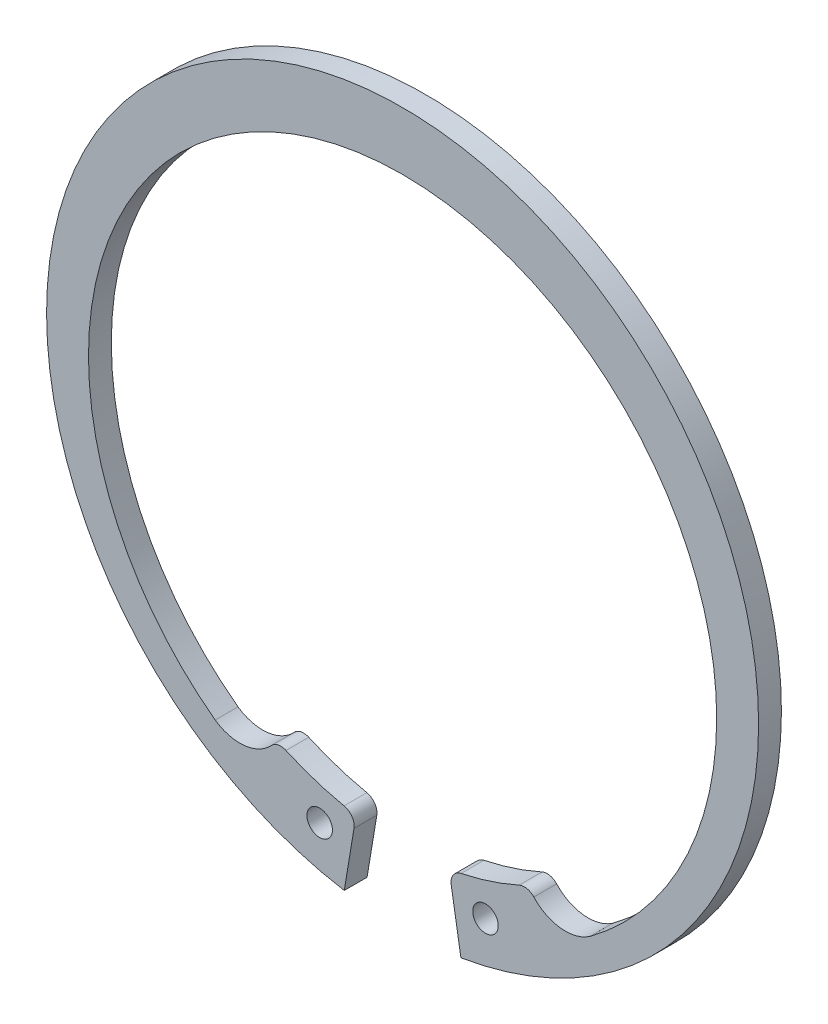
ISO-10303-21;
HEADER;
FILE_DESCRIPTION(('STEP AP214'),'2;1');
FILE_NAME('part.step','',(''),(''),'','','');
FILE_SCHEMA(('AUTOMOTIVE_DESIGN { 1 0 10303 214 1 1 1 1 }'));
ENDSEC;
DATA;
#1=APPLICATION_CONTEXT('core data for automotive mechanical design processes');
#2=APPLICATION_PROTOCOL_DEFINITION('international standard','automotive_design',2000,#1);
#3=PRODUCT_CONTEXT('',#1,'mechanical');
#4=PRODUCT('Part','Part','',(#3));
#5=PRODUCT_RELATED_PRODUCT_CATEGORY('part','',(#4));
#6=PRODUCT_DEFINITION_FORMATION('','',#4);
#7=PRODUCT_DEFINITION_CONTEXT('part definition',#1,'design');
#8=PRODUCT_DEFINITION('design','',#6,#7);
#9=PRODUCT_DEFINITION_SHAPE('','',#8);
#10=(LENGTH_UNIT() NAMED_UNIT(*) SI_UNIT(.MILLI.,.METRE.));
#11=(NAMED_UNIT(*) PLANE_ANGLE_UNIT() SI_UNIT($,.RADIAN.));
#12=(NAMED_UNIT(*) SI_UNIT($,.STERADIAN.) SOLID_ANGLE_UNIT());
#13=UNCERTAINTY_MEASURE_WITH_UNIT(LENGTH_MEASURE(1.E-05),#10,'distance_accuracy_value','');
#14=(GEOMETRIC_REPRESENTATION_CONTEXT(3) GLOBAL_UNCERTAINTY_ASSIGNED_CONTEXT((#13)) GLOBAL_UNIT_ASSIGNED_CONTEXT((#10,
#11,#12)) REPRESENTATION_CONTEXT('',''));
#15=CARTESIAN_POINT('',(0.,0.,0.));
#16=DIRECTION('',(0.,0.,1.));
#17=DIRECTION('',(1.,0.,0.));
#18=AXIS2_PLACEMENT_3D('',#15,#16,#17);
#19=CARTESIAN_POINT('',(0.,0.,-2.5));
#20=DIRECTION('',(0.,0.,1.));
#21=DIRECTION('',(1.00000000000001,0.,0.));
#22=AXIS2_PLACEMENT_3D('',#19,#20,#21);
#23=CYLINDRICAL_SURFACE('',#22,39.);
#24=CARTESIAN_POINT('',(0.,0.,-2.5));
#25=DIRECTION('',(0.,0.,1.));
#26=DIRECTION('',(1.00000000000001,0.,0.));
#27=AXIS2_PLACEMENT_3D('',#24,#25,#26);
#28=CIRCLE('',#27,39.);
#29=CARTESIAN_POINT('',(6.38934128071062,-38.4730596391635,-2.5));
#30=VERTEX_POINT('',#29);
#31=CARTESIAN_POINT('',(-6.38934128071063,-38.4730596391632,-2.5));
#32=VERTEX_POINT('',#31);
#33=EDGE_CURVE('E48',#30,#32,#28,.T.);
#34=ORIENTED_EDGE('',*,*,#33,.T.);
#35=DIRECTION('',(0.,0.,1.));
#36=VECTOR('',#35,1.);
#37=CARTESIAN_POINT('',(-6.38934128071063,-38.4730596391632,-2.5));
#38=LINE('',#37,#36);
#39=CARTESIAN_POINT('',(-6.38934128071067,-38.4730596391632,0.));
#40=VERTEX_POINT('',#39);
#41=EDGE_CURVE('E35',#32,#40,#38,.T.);
#42=ORIENTED_EDGE('',*,*,#41,.T.);
#43=CARTESIAN_POINT('',(0.,0.,0.));
#44=DIRECTION('',(0.,0.,1.));
#45=DIRECTION('',(1.00000000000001,0.,0.));
#46=AXIS2_PLACEMENT_3D('',#43,#44,#45);
#47=CIRCLE('',#46,39.);
#48=CARTESIAN_POINT('',(6.38934128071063,-38.4730596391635,0.));
#49=VERTEX_POINT('',#48);
#50=EDGE_CURVE('E137',#49,#40,#47,.T.);
#51=ORIENTED_EDGE('',*,*,#50,.F.);
#52=DIRECTION('',(0.,0.,1.));
#53=VECTOR('',#52,1.);
#54=CARTESIAN_POINT('',(6.38934128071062,-38.4730596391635,-2.5));
#55=LINE('',#54,#53);
#56=EDGE_CURVE('E11',#30,#49,#55,.T.);
#57=ORIENTED_EDGE('',*,*,#56,.F.);
#58=EDGE_LOOP('',(#34,#42,#51,#57));
#59=FACE_BOUND('',#58,.T.);
#60=ADVANCED_FACE('F32',(#59),#23,.T.);
#61=CARTESIAN_POINT('',(6.38934128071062,-38.4730596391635,-2.5));
#62=DIRECTION('',(-0.986488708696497,-0.163829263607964,0.));
#63=DIRECTION('',(0.163829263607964,-0.986488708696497,0.));
#64=AXIS2_PLACEMENT_3D('',#61,#62,#63);
#65=PLANE('',#64);
#66=DIRECTION('',(0.163829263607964,-0.986488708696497,0.));
#67=VECTOR('',#66,1.);
#68=CARTESIAN_POINT('',(6.38934128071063,-38.4730596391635,0.));
#69=LINE('',#68,#67);
#70=CARTESIAN_POINT('',(5.32330141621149,-32.0539604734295,0.));
#71=VERTEX_POINT('',#70);
#72=EDGE_CURVE('E245',#71,#49,#69,.T.);
#73=ORIENTED_EDGE('',*,*,#72,.F.);
#74=DIRECTION('',(0.,0.,1.));
#75=VECTOR('',#74,1.);
#76=CARTESIAN_POINT('',(5.32330141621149,-32.0539604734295,-2.5));
#77=LINE('',#76,#75);
#78=CARTESIAN_POINT('',(5.32330141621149,-32.0539604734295,-2.5));
#79=VERTEX_POINT('',#78);
#80=EDGE_CURVE('E215',#79,#71,#77,.T.);
#81=ORIENTED_EDGE('',*,*,#80,.F.);
#82=DIRECTION('',(0.163829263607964,-0.986488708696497,0.));
#83=VECTOR('',#82,1.);
#84=CARTESIAN_POINT('',(6.38934128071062,-38.4730596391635,-2.5));
#85=LINE('',#84,#83);
#86=EDGE_CURVE('E251',#79,#30,#85,.T.);
#87=ORIENTED_EDGE('',*,*,#86,.T.);
#88=ORIENTED_EDGE('',*,*,#56,.T.);
#89=EDGE_LOOP('',(#73,#81,#87,#88));
#90=FACE_BOUND('',#89,.T.);
#91=ADVANCED_FACE('F300',(#90),#65,.T.);
#92=CARTESIAN_POINT('',(0.,-1.75846288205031,-2.5));
#93=DIRECTION('',(0.,0.,1.));
#94=DIRECTION('',(1.00000000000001,0.,0.));
#95=AXIS2_PLACEMENT_3D('',#92,#93,#94);
#96=CYLINDRICAL_SURFACE('',#95,34.4084628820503);
#97=DIRECTION('',(0.,0.,1.));
#98=VECTOR('',#97,1.);
#99=CARTESIAN_POINT('',(-20.5265696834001,-29.3737169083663,-2.5));
#100=LINE('',#99,#98);
#101=CARTESIAN_POINT('',(-20.5265696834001,-29.3737169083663,-2.5));
#102=VERTEX_POINT('',#101);
#103=CARTESIAN_POINT('',(-20.5265696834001,-29.3737169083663,0.));
#104=VERTEX_POINT('',#103);
#105=EDGE_CURVE('E180',#102,#104,#100,.T.);
#106=ORIENTED_EDGE('',*,*,#105,.F.);
#107=CARTESIAN_POINT('',(0.,-1.75846288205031,-2.5));
#108=DIRECTION('',(0.,0.,-1.));
#109=DIRECTION('',(1.00000000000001,0.,0.));
#110=AXIS2_PLACEMENT_3D('',#107,#108,#109);
#111=CIRCLE('',#110,34.4084628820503);
#112=CARTESIAN_POINT('',(20.5265696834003,-29.3737169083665,-2.5));
#113=VERTEX_POINT('',#112);
#114=EDGE_CURVE('E249',#102,#113,#111,.T.);
#115=ORIENTED_EDGE('',*,*,#114,.T.);
#116=DIRECTION('',(0.,0.,1.));
#117=VECTOR('',#116,1.);
#118=CARTESIAN_POINT('',(20.5265696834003,-29.3737169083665,-2.5));
#119=LINE('',#118,#117);
#120=CARTESIAN_POINT('',(20.5265696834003,-29.3737169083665,0.));
#121=VERTEX_POINT('',#120);
#122=EDGE_CURVE('E218',#121,#113,#119,.F.);
#123=ORIENTED_EDGE('',*,*,#122,.F.);
#124=CARTESIAN_POINT('',(0.,-1.75846288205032,0.));
#125=DIRECTION('',(0.,0.,-1.));
#126=DIRECTION('',(1.00000000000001,0.,0.));
#127=AXIS2_PLACEMENT_3D('',#124,#125,#126);
#128=CIRCLE('',#127,34.4084628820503);
#129=EDGE_CURVE('E139',#104,#121,#128,.T.);
#130=ORIENTED_EDGE('',*,*,#129,.F.);
#131=EDGE_LOOP('',(#106,#115,#123,#130));
#132=FACE_BOUND('',#131,.T.);
#133=ADVANCED_FACE('F279',(#132),#96,.F.);
#134=CARTESIAN_POINT('',(-6.38934128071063,-38.4730596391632,-2.5));
#135=DIRECTION('',(0.986488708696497,-0.163829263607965,0.));
#136=DIRECTION('',(0.163829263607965,0.986488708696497,0.));
#137=AXIS2_PLACEMENT_3D('',#134,#135,#136);
#138=PLANE('',#137);
#139=DIRECTION('',(0.163829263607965,0.986488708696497,0.));
#140=VECTOR('',#139,1.);
#141=CARTESIAN_POINT('',(-6.38934128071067,-38.4730596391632,0.));
#142=LINE('',#141,#140);
#143=CARTESIAN_POINT('',(-5.32330141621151,-32.0539604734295,0.));
#144=VERTEX_POINT('',#143);
#145=EDGE_CURVE('E129',#40,#144,#142,.T.);
#146=ORIENTED_EDGE('',*,*,#145,.F.);
#147=ORIENTED_EDGE('',*,*,#41,.F.);
#148=DIRECTION('',(0.163829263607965,0.986488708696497,0.));
#149=VECTOR('',#148,1.);
#150=CARTESIAN_POINT('',(-6.38934128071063,-38.4730596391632,-2.5));
#151=LINE('',#150,#149);
#152=CARTESIAN_POINT('',(-5.32330141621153,-32.0539604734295,-2.5));
#153=VERTEX_POINT('',#152);
#154=EDGE_CURVE('E145',#32,#153,#151,.T.);
#155=ORIENTED_EDGE('',*,*,#154,.T.);
#156=DIRECTION('',(0.,0.,1.));
#157=VECTOR('',#156,1.);
#158=CARTESIAN_POINT('',(-5.32330141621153,-32.0539604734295,-2.5));
#159=LINE('',#158,#157);
#160=EDGE_CURVE('E142',#153,#144,#159,.T.);
#161=ORIENTED_EDGE('',*,*,#160,.T.);
#162=EDGE_LOOP('',(#146,#147,#155,#161));
#163=FACE_BOUND('',#162,.T.);
#164=ADVANCED_FACE('F143',(#163),#138,.T.);
#165=CARTESIAN_POINT('',(0.,0.,-2.5));
#166=DIRECTION('',(0.,0.,1.));
#167=DIRECTION('',(1.00000000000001,0.,0.));
#168=AXIS2_PLACEMENT_3D('',#165,#166,#167);
#169=PLANE('',#168);
#170=ORIENTED_EDGE('',*,*,#114,.F.);
#171=DIRECTION('',(-0.572806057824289,-0.819690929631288,0.));
#172=VECTOR('',#171,1.);
#173=CARTESIAN_POINT('',(-22.339436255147,-31.9679462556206,-2.5));
#174=LINE('',#173,#172);
#175=CARTESIAN_POINT('',(-20.5252304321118,-29.3718004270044,-2.5));
#176=VERTEX_POINT('',#175);
#177=EDGE_CURVE('E150',#176,#102,#174,.T.);
#178=ORIENTED_EDGE('',*,*,#177,.F.);
#179=CARTESIAN_POINT('',(-17.8291613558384,-25.5136998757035,-2.5));
#180=DIRECTION('',(0.,0.,-1.));
#181=DIRECTION('',(1.00000000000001,0.,0.));
#182=AXIS2_PLACEMENT_3D('',#179,#180,#181);
#183=CIRCLE('',#182,4.70677472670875);
#184=CARTESIAN_POINT('',(-14.3734482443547,-28.7092867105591,-2.5));
#185=VERTEX_POINT('',#184);
#186=EDGE_CURVE('E174',#185,#176,#183,.T.);
#187=ORIENTED_EDGE('',*,*,#186,.F.);
#188=CARTESIAN_POINT('',(-13.3477711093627,-29.6577567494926,-2.5));
#189=DIRECTION('',(0.,0.,1.));
#190=DIRECTION('',(1.00000000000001,0.,0.));
#191=AXIS2_PLACEMENT_3D('',#188,#189,#190);
#192=CIRCLE('',#191,1.397);
#193=CARTESIAN_POINT('',(-12.7744280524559,-28.3838310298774,-2.5));
#194=VERTEX_POINT('',#193);
#195=EDGE_CURVE('E171',#194,#185,#192,.T.);
#196=ORIENTED_EDGE('',*,*,#195,.F.);
#197=CARTESIAN_POINT('',(0.,0.,-2.5));
#198=DIRECTION('',(0.,0.,-1.));
#199=DIRECTION('',(1.00000000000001,0.,0.));
#200=AXIS2_PLACEMENT_3D('',#197,#198,#199);
#201=CIRCLE('',#200,31.126);
#202=CARTESIAN_POINT('',(-6.41357162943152,-30.4580691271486,-2.5));
#203=VERTEX_POINT('',#202);
#204=EDGE_CURVE('E169',#203,#194,#201,.T.);
#205=ORIENTED_EDGE('',*,*,#204,.F.);
#206=CARTESIAN_POINT('',(-6.70142614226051,-31.8250909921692,-2.5));
#207=DIRECTION('',(0.,0.,1.));
#208=DIRECTION('',(-1.00000000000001,0.,0.));
#209=AXIS2_PLACEMENT_3D('',#206,#207,#208);
#210=CIRCLE('',#209,1.397);
#211=EDGE_CURVE('E167',#153,#203,#210,.T.);
#212=ORIENTED_EDGE('',*,*,#211,.F.);
#213=ORIENTED_EDGE('',*,*,#154,.F.);
#214=ORIENTED_EDGE('',*,*,#33,.F.);
#215=ORIENTED_EDGE('',*,*,#86,.F.);
#216=CARTESIAN_POINT('',(6.70142614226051,-31.8250909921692,-2.5));
#217=DIRECTION('',(0.,0.,1.));
#218=DIRECTION('',(1.00000000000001,0.,0.));
#219=AXIS2_PLACEMENT_3D('',#216,#217,#218);
#220=CIRCLE('',#219,1.39699999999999);
#221=CARTESIAN_POINT('',(6.41357162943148,-30.4580691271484,-2.5));
#222=VERTEX_POINT('',#221);
#223=EDGE_CURVE('E211',#222,#79,#220,.T.);
#224=ORIENTED_EDGE('',*,*,#223,.F.);
#225=CARTESIAN_POINT('',(0.,0.,-2.5));
#226=DIRECTION('',(0.,0.,-1.));
#227=DIRECTION('',(1.00000000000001,0.,0.));
#228=AXIS2_PLACEMENT_3D('',#225,#226,#227);
#229=CIRCLE('',#228,31.126);
#230=CARTESIAN_POINT('',(12.7744280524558,-28.3838310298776,-2.5));
#231=VERTEX_POINT('',#230);
#232=EDGE_CURVE('E209',#231,#222,#229,.T.);
#233=ORIENTED_EDGE('',*,*,#232,.F.);
#234=CARTESIAN_POINT('',(13.3477711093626,-29.6577567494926,-2.5));
#235=DIRECTION('',(0.,0.,1.));
#236=DIRECTION('',(-1.00000000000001,0.,0.));
#237=AXIS2_PLACEMENT_3D('',#234,#235,#236);
#238=CIRCLE('',#237,1.397);
#239=CARTESIAN_POINT('',(14.3734482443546,-28.7092867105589,-2.5));
#240=VERTEX_POINT('',#239);
#241=EDGE_CURVE('E206',#240,#231,#238,.T.);
#242=ORIENTED_EDGE('',*,*,#241,.F.);
#243=CARTESIAN_POINT('',(17.8291613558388,-25.5136998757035,-2.5));
#244=DIRECTION('',(0.,0.,-1.));
#245=DIRECTION('',(1.00000000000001,0.,0.));
#246=AXIS2_PLACEMENT_3D('',#243,#244,#245);
#247=CIRCLE('',#246,4.70677472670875);
#248=CARTESIAN_POINT('',(20.5252304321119,-29.3718004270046,-2.5));
#249=VERTEX_POINT('',#248);
#250=EDGE_CURVE('E203',#249,#240,#247,.T.);
#251=ORIENTED_EDGE('',*,*,#250,.F.);
#252=DIRECTION('',(-0.572806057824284,0.819690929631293,0.));
#253=VECTOR('',#252,1.);
#254=CARTESIAN_POINT('',(20.5252304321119,-29.3718004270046,-2.5));
#255=LINE('',#254,#253);
#256=EDGE_CURVE('E201',#113,#249,#255,.T.);
#257=ORIENTED_EDGE('',*,*,#256,.F.);
#258=EDGE_LOOP('',(#170,#178,#187,#196,#205,#212,#213,#214,#215,#224,#233,#242,#251,#257));
#259=FACE_BOUND('',#258,.T.);
#260=CARTESIAN_POINT('',(9.08165932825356,-33.4003477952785,-2.5));
#261=DIRECTION('',(0.,0.,1.));
#262=DIRECTION('',(1.00000000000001,0.,0.));
#263=AXIS2_PLACEMENT_3D('',#260,#261,#262);
#264=CIRCLE('',#263,1.397);
#265=CARTESIAN_POINT('',(10.4786593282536,-33.4003477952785,-2.5));
#266=VERTEX_POINT('',#265);
#267=EDGE_CURVE('E240',#266,#266,#264,.T.);
#268=ORIENTED_EDGE('',*,*,#267,.T.);
#269=EDGE_LOOP('',(#268));
#270=FACE_BOUND('',#269,.T.);
#271=CARTESIAN_POINT('',(-9.08165932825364,-33.4003477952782,-2.5));
#272=DIRECTION('',(0.,0.,1.));
#273=DIRECTION('',(1.00000000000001,0.,0.));
#274=AXIS2_PLACEMENT_3D('',#271,#272,#273);
#275=CIRCLE('',#274,1.397);
#276=CARTESIAN_POINT('',(-7.68465932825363,-33.4003477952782,-2.5));
#277=VERTEX_POINT('',#276);
#278=EDGE_CURVE('E234',#277,#277,#275,.T.);
#279=ORIENTED_EDGE('',*,*,#278,.T.);
#280=EDGE_LOOP('',(#279));
#281=FACE_BOUND('',#280,.T.);
#282=ADVANCED_FACE('F257',(#259,#270,#281),#169,.F.);
#283=CARTESIAN_POINT('',(0.,0.,0.));
#284=DIRECTION('',(0.,0.,1.));
#285=DIRECTION('',(1.00000000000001,0.,0.));
#286=AXIS2_PLACEMENT_3D('',#283,#284,#285);
#287=PLANE('',#286);
#288=DIRECTION('',(-0.572806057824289,-0.819690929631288,0.));
#289=VECTOR('',#288,1.);
#290=CARTESIAN_POINT('',(-22.339436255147,-31.9679462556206,0.));
#291=LINE('',#290,#289);
#292=CARTESIAN_POINT('',(-20.5252304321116,-29.3718004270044,0.));
#293=VERTEX_POINT('',#292);
#294=EDGE_CURVE('E165',#293,#104,#291,.T.);
#295=ORIENTED_EDGE('',*,*,#294,.T.);
#296=ORIENTED_EDGE('',*,*,#129,.T.);
#297=DIRECTION('',(-0.572806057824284,0.819690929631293,0.));
#298=VECTOR('',#297,1.);
#299=CARTESIAN_POINT('',(20.5252304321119,-29.3718004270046,0.));
#300=LINE('',#299,#298);
#301=CARTESIAN_POINT('',(20.5252304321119,-29.3718004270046,0.));
#302=VERTEX_POINT('',#301);
#303=EDGE_CURVE('E188',#121,#302,#300,.T.);
#304=ORIENTED_EDGE('',*,*,#303,.T.);
#305=CARTESIAN_POINT('',(17.8291613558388,-25.5136998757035,0.));
#306=DIRECTION('',(0.,0.,-1.));
#307=DIRECTION('',(1.00000000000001,0.,0.));
#308=AXIS2_PLACEMENT_3D('',#305,#306,#307);
#309=CIRCLE('',#308,4.70677472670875);
#310=CARTESIAN_POINT('',(14.3734482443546,-28.7092867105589,0.));
#311=VERTEX_POINT('',#310);
#312=EDGE_CURVE('E190',#302,#311,#309,.T.);
#313=ORIENTED_EDGE('',*,*,#312,.T.);
#314=CARTESIAN_POINT('',(13.3477711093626,-29.6577567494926,0.));
#315=DIRECTION('',(0.,0.,1.));
#316=DIRECTION('',(-1.00000000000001,0.,0.));
#317=AXIS2_PLACEMENT_3D('',#314,#315,#316);
#318=CIRCLE('',#317,1.397);
#319=CARTESIAN_POINT('',(12.7744280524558,-28.3838310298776,0.));
#320=VERTEX_POINT('',#319);
#321=EDGE_CURVE('E193',#311,#320,#318,.T.);
#322=ORIENTED_EDGE('',*,*,#321,.T.);
#323=CARTESIAN_POINT('',(0.,0.,0.));
#324=DIRECTION('',(0.,0.,-1.));
#325=DIRECTION('',(1.00000000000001,0.,0.));
#326=AXIS2_PLACEMENT_3D('',#323,#324,#325);
#327=CIRCLE('',#326,31.126);
#328=CARTESIAN_POINT('',(6.41357162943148,-30.4580691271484,0.));
#329=VERTEX_POINT('',#328);
#330=EDGE_CURVE('E196',#320,#329,#327,.T.);
#331=ORIENTED_EDGE('',*,*,#330,.T.);
#332=CARTESIAN_POINT('',(6.7014261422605,-31.8250909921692,0.));
#333=DIRECTION('',(0.,0.,1.));
#334=DIRECTION('',(1.00000000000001,0.,0.));
#335=AXIS2_PLACEMENT_3D('',#332,#333,#334);
#336=CIRCLE('',#335,1.39699999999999);
#337=EDGE_CURVE('E198',#329,#71,#336,.T.);
#338=ORIENTED_EDGE('',*,*,#337,.T.);
#339=ORIENTED_EDGE('',*,*,#72,.T.);
#340=ORIENTED_EDGE('',*,*,#50,.T.);
#341=ORIENTED_EDGE('',*,*,#145,.T.);
#342=CARTESIAN_POINT('',(-6.70142614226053,-31.8250909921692,0.));
#343=DIRECTION('',(0.,0.,1.));
#344=DIRECTION('',(-1.00000000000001,0.,0.));
#345=AXIS2_PLACEMENT_3D('',#342,#343,#344);
#346=CIRCLE('',#345,1.397);
#347=CARTESIAN_POINT('',(-6.41357162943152,-30.4580691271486,0.));
#348=VERTEX_POINT('',#347);
#349=EDGE_CURVE('E135',#144,#348,#346,.T.);
#350=ORIENTED_EDGE('',*,*,#349,.T.);
#351=CARTESIAN_POINT('',(0.,0.,0.));
#352=DIRECTION('',(0.,0.,-1.));
#353=DIRECTION('',(1.00000000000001,0.,0.));
#354=AXIS2_PLACEMENT_3D('',#351,#352,#353);
#355=CIRCLE('',#354,31.126);
#356=CARTESIAN_POINT('',(-12.7744280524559,-28.3838310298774,0.));
#357=VERTEX_POINT('',#356);
#358=EDGE_CURVE('E155',#348,#357,#355,.T.);
#359=ORIENTED_EDGE('',*,*,#358,.T.);
#360=CARTESIAN_POINT('',(-13.3477711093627,-29.6577567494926,0.));
#361=DIRECTION('',(0.,0.,1.));
#362=DIRECTION('',(1.00000000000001,0.,0.));
#363=AXIS2_PLACEMENT_3D('',#360,#361,#362);
#364=CIRCLE('',#363,1.397);
#365=CARTESIAN_POINT('',(-14.3734482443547,-28.7092867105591,0.));
#366=VERTEX_POINT('',#365);
#367=EDGE_CURVE('E157',#357,#366,#364,.T.);
#368=ORIENTED_EDGE('',*,*,#367,.T.);
#369=CARTESIAN_POINT('',(-17.8291613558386,-25.5136998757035,0.));
#370=DIRECTION('',(0.,0.,-1.));
#371=DIRECTION('',(1.00000000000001,0.,0.));
#372=AXIS2_PLACEMENT_3D('',#369,#370,#371);
#373=CIRCLE('',#372,4.70677472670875);
#374=EDGE_CURVE('E162',#366,#293,#373,.T.);
#375=ORIENTED_EDGE('',*,*,#374,.T.);
#376=EDGE_LOOP('',(#295,#296,#304,#313,#322,#331,#338,#339,#340,#341,#350,#359,#368,#375));
#377=FACE_BOUND('',#376,.T.);
#378=CARTESIAN_POINT('',(9.08165932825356,-33.4003477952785,0.));
#379=DIRECTION('',(0.,0.,1.));
#380=DIRECTION('',(1.00000000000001,0.,0.));
#381=AXIS2_PLACEMENT_3D('',#378,#379,#380);
#382=CIRCLE('',#381,1.397);
#383=CARTESIAN_POINT('',(10.4786593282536,-33.4003477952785,0.));
#384=VERTEX_POINT('',#383);
#385=EDGE_CURVE('E237',#384,#384,#382,.T.);
#386=ORIENTED_EDGE('',*,*,#385,.F.);
#387=EDGE_LOOP('',(#386));
#388=FACE_BOUND('',#387,.T.);
#389=CARTESIAN_POINT('',(-9.08165932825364,-33.4003477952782,0.));
#390=DIRECTION('',(0.,0.,1.));
#391=DIRECTION('',(1.00000000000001,0.,0.));
#392=AXIS2_PLACEMENT_3D('',#389,#390,#391);
#393=CIRCLE('',#392,1.397);
#394=CARTESIAN_POINT('',(-7.68465932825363,-33.4003477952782,0.));
#395=VERTEX_POINT('',#394);
#396=EDGE_CURVE('E231',#395,#395,#393,.T.);
#397=ORIENTED_EDGE('',*,*,#396,.F.);
#398=EDGE_LOOP('',(#397));
#399=FACE_BOUND('',#398,.T.);
#400=ADVANCED_FACE('F132',(#377,#388,#399),#287,.T.);
#401=CARTESIAN_POINT('',(9.08165932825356,-33.4003477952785,-2.5));
#402=DIRECTION('',(0.,0.,1.));
#403=DIRECTION('',(1.00000000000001,0.,0.));
#404=AXIS2_PLACEMENT_3D('',#401,#402,#403);
#405=CYLINDRICAL_SURFACE('',#404,1.397);
#406=ORIENTED_EDGE('',*,*,#267,.F.);
#407=EDGE_LOOP('',(#406));
#408=FACE_BOUND('',#407,.T.);
#409=ORIENTED_EDGE('',*,*,#385,.T.);
#410=EDGE_LOOP('',(#409));
#411=FACE_BOUND('',#410,.T.);
#412=ADVANCED_FACE('F317',(#408,#411),#405,.F.);
#413=CARTESIAN_POINT('',(-9.08165932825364,-33.4003477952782,-2.5));
#414=DIRECTION('',(0.,0.,1.));
#415=DIRECTION('',(1.00000000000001,0.,0.));
#416=AXIS2_PLACEMENT_3D('',#413,#414,#415);
#417=CYLINDRICAL_SURFACE('',#416,1.397);
#418=ORIENTED_EDGE('',*,*,#278,.F.);
#419=EDGE_LOOP('',(#418));
#420=FACE_BOUND('',#419,.T.);
#421=ORIENTED_EDGE('',*,*,#396,.T.);
#422=EDGE_LOOP('',(#421));
#423=FACE_BOUND('',#422,.T.);
#424=ADVANCED_FACE('F321',(#420,#423),#417,.F.);
#425=CARTESIAN_POINT('',(0.,0.,-2.5));
#426=DIRECTION('',(0.,0.,1.));
#427=DIRECTION('',(1.00000000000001,0.,0.));
#428=AXIS2_PLACEMENT_3D('',#425,#426,#427);
#429=CYLINDRICAL_SURFACE('',#428,31.126);
#430=ORIENTED_EDGE('',*,*,#330,.F.);
#431=DIRECTION('',(0.,0.,1.));
#432=VECTOR('',#431,1.);
#433=CARTESIAN_POINT('',(12.7744280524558,-28.3838310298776,-2.5));
#434=LINE('',#433,#432);
#435=EDGE_CURVE('E222',#231,#320,#434,.T.);
#436=ORIENTED_EDGE('',*,*,#435,.F.);
#437=ORIENTED_EDGE('',*,*,#232,.T.);
#438=DIRECTION('',(0.,0.,1.));
#439=VECTOR('',#438,1.);
#440=CARTESIAN_POINT('',(6.41357162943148,-30.4580691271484,-2.5));
#441=LINE('',#440,#439);
#442=EDGE_CURVE('E219',#222,#329,#441,.T.);
#443=ORIENTED_EDGE('',*,*,#442,.T.);
#444=EDGE_LOOP('',(#430,#436,#437,#443));
#445=FACE_BOUND('',#444,.T.);
#446=ADVANCED_FACE('F294',(#445),#429,.F.);
#447=CARTESIAN_POINT('',(6.70142614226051,-31.8250909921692,-2.5));
#448=DIRECTION('',(0.,0.,1.));
#449=DIRECTION('',(1.00000000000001,0.,0.));
#450=AXIS2_PLACEMENT_3D('',#447,#448,#449);
#451=CYLINDRICAL_SURFACE('',#450,1.39699999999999);
#452=ORIENTED_EDGE('',*,*,#337,.F.);
#453=ORIENTED_EDGE('',*,*,#442,.F.);
#454=ORIENTED_EDGE('',*,*,#223,.T.);
#455=ORIENTED_EDGE('',*,*,#80,.T.);
#456=EDGE_LOOP('',(#452,#453,#454,#455));
#457=FACE_BOUND('',#456,.T.);
#458=ADVANCED_FACE('F299',(#457),#451,.T.);
#459=CARTESIAN_POINT('',(13.3477711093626,-29.6577567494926,-2.5));
#460=DIRECTION('',(0.,0.,1.));
#461=DIRECTION('',(1.00000000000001,0.,0.));
#462=AXIS2_PLACEMENT_3D('',#459,#460,#461);
#463=CYLINDRICAL_SURFACE('',#462,1.397);
#464=ORIENTED_EDGE('',*,*,#321,.F.);
#465=DIRECTION('',(0.,0.,1.));
#466=VECTOR('',#465,1.);
#467=CARTESIAN_POINT('',(14.3734482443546,-28.7092867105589,-2.5));
#468=LINE('',#467,#466);
#469=EDGE_CURVE('E225',#240,#311,#468,.T.);
#470=ORIENTED_EDGE('',*,*,#469,.F.);
#471=ORIENTED_EDGE('',*,*,#241,.T.);
#472=ORIENTED_EDGE('',*,*,#435,.T.);
#473=EDGE_LOOP('',(#464,#470,#471,#472));
#474=FACE_BOUND('',#473,.T.);
#475=ADVANCED_FACE('F291',(#474),#463,.T.);
#476=CARTESIAN_POINT('',(17.8291613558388,-25.5136998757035,-2.5));
#477=DIRECTION('',(0.,0.,1.));
#478=DIRECTION('',(1.00000000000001,0.,0.));
#479=AXIS2_PLACEMENT_3D('',#476,#477,#478);
#480=CYLINDRICAL_SURFACE('',#479,4.70677472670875);
#481=ORIENTED_EDGE('',*,*,#312,.F.);
#482=DIRECTION('',(0.,0.,1.));
#483=VECTOR('',#482,1.);
#484=CARTESIAN_POINT('',(20.5252304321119,-29.3718004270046,-2.5));
#485=LINE('',#484,#483);
#486=EDGE_CURVE('E214',#249,#302,#485,.T.);
#487=ORIENTED_EDGE('',*,*,#486,.F.);
#488=ORIENTED_EDGE('',*,*,#250,.T.);
#489=ORIENTED_EDGE('',*,*,#469,.T.);
#490=EDGE_LOOP('',(#481,#487,#488,#489));
#491=FACE_BOUND('',#490,.T.);
#492=ADVANCED_FACE('F288',(#491),#480,.F.);
#493=CARTESIAN_POINT('',(20.5252304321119,-29.3718004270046,-2.5));
#494=DIRECTION('',(0.819690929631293,0.572806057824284,0.));
#495=DIRECTION('',(-0.572806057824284,0.819690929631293,0.));
#496=AXIS2_PLACEMENT_3D('',#493,#494,#495);
#497=PLANE('',#496);
#498=ORIENTED_EDGE('',*,*,#303,.F.);
#499=ORIENTED_EDGE('',*,*,#122,.T.);
#500=ORIENTED_EDGE('',*,*,#256,.T.);
#501=ORIENTED_EDGE('',*,*,#486,.T.);
#502=EDGE_LOOP('',(#498,#499,#500,#501));
#503=FACE_BOUND('',#502,.T.);
#504=ADVANCED_FACE('F282',(#503),#497,.T.);
#505=CARTESIAN_POINT('',(0.,0.,-2.5));
#506=DIRECTION('',(0.,0.,1.));
#507=DIRECTION('',(1.00000000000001,0.,0.));
#508=AXIS2_PLACEMENT_3D('',#505,#506,#507);
#509=CYLINDRICAL_SURFACE('',#508,31.126);
#510=ORIENTED_EDGE('',*,*,#358,.F.);
#511=DIRECTION('',(0.,0.,1.));
#512=VECTOR('',#511,1.);
#513=CARTESIAN_POINT('',(-6.41357162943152,-30.4580691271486,-2.5));
#514=LINE('',#513,#512);
#515=EDGE_CURVE('E149',#203,#348,#514,.T.);
#516=ORIENTED_EDGE('',*,*,#515,.F.);
#517=ORIENTED_EDGE('',*,*,#204,.T.);
#518=DIRECTION('',(0.,0.,1.));
#519=VECTOR('',#518,1.);
#520=CARTESIAN_POINT('',(-12.7744280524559,-28.3838310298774,-2.5));
#521=LINE('',#520,#519);
#522=EDGE_CURVE('E183',#194,#357,#521,.T.);
#523=ORIENTED_EDGE('',*,*,#522,.T.);
#524=EDGE_LOOP('',(#510,#516,#517,#523));
#525=FACE_BOUND('',#524,.T.);
#526=ADVANCED_FACE('F263',(#525),#509,.F.);
#527=CARTESIAN_POINT('',(-22.339436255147,-31.9679462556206,-2.5));
#528=DIRECTION('',(-0.819690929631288,0.572806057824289,0.));
#529=DIRECTION('',(-0.572806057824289,-0.819690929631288,0.));
#530=AXIS2_PLACEMENT_3D('',#527,#528,#529);
#531=PLANE('',#530);
#532=ORIENTED_EDGE('',*,*,#177,.T.);
#533=ORIENTED_EDGE('',*,*,#105,.T.);
#534=ORIENTED_EDGE('',*,*,#294,.F.);
#535=DIRECTION('',(0.,0.,1.));
#536=VECTOR('',#535,1.);
#537=CARTESIAN_POINT('',(-20.5252304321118,-29.3718004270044,-2.5));
#538=LINE('',#537,#536);
#539=EDGE_CURVE('E178',#176,#293,#538,.T.);
#540=ORIENTED_EDGE('',*,*,#539,.F.);
#541=EDGE_LOOP('',(#532,#533,#534,#540));
#542=FACE_BOUND('',#541,.T.);
#543=ADVANCED_FACE('F273',(#542),#531,.T.);
#544=CARTESIAN_POINT('',(-17.8291613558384,-25.5136998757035,-2.5));
#545=DIRECTION('',(0.,0.,1.));
#546=DIRECTION('',(1.00000000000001,0.,0.));
#547=AXIS2_PLACEMENT_3D('',#544,#545,#546);
#548=CYLINDRICAL_SURFACE('',#547,4.70677472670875);
#549=ORIENTED_EDGE('',*,*,#374,.F.);
#550=DIRECTION('',(0.,0.,1.));
#551=VECTOR('',#550,1.);
#552=CARTESIAN_POINT('',(-14.3734482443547,-28.7092867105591,-2.5));
#553=LINE('',#552,#551);
#554=EDGE_CURVE('E181',#185,#366,#553,.T.);
#555=ORIENTED_EDGE('',*,*,#554,.F.);
#556=ORIENTED_EDGE('',*,*,#186,.T.);
#557=ORIENTED_EDGE('',*,*,#539,.T.);
#558=EDGE_LOOP('',(#549,#555,#556,#557));
#559=FACE_BOUND('',#558,.T.);
#560=ADVANCED_FACE('F270',(#559),#548,.F.);
#561=CARTESIAN_POINT('',(-13.3477711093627,-29.6577567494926,-2.5));
#562=DIRECTION('',(0.,0.,1.));
#563=DIRECTION('',(1.00000000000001,0.,0.));
#564=AXIS2_PLACEMENT_3D('',#561,#562,#563);
#565=CYLINDRICAL_SURFACE('',#564,1.397);
#566=ORIENTED_EDGE('',*,*,#367,.F.);
#567=ORIENTED_EDGE('',*,*,#522,.F.);
#568=ORIENTED_EDGE('',*,*,#195,.T.);
#569=ORIENTED_EDGE('',*,*,#554,.T.);
#570=EDGE_LOOP('',(#566,#567,#568,#569));
#571=FACE_BOUND('',#570,.T.);
#572=ADVANCED_FACE('F268',(#571),#565,.T.);
#573=CARTESIAN_POINT('',(-6.70142614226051,-31.8250909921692,-2.5));
#574=DIRECTION('',(0.,0.,1.));
#575=DIRECTION('',(1.00000000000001,0.,0.));
#576=AXIS2_PLACEMENT_3D('',#573,#574,#575);
#577=CYLINDRICAL_SURFACE('',#576,1.397);
#578=ORIENTED_EDGE('',*,*,#349,.F.);
#579=ORIENTED_EDGE('',*,*,#160,.F.);
#580=ORIENTED_EDGE('',*,*,#211,.T.);
#581=ORIENTED_EDGE('',*,*,#515,.T.);
#582=EDGE_LOOP('',(#578,#579,#580,#581));
#583=FACE_BOUND('',#582,.T.);
#584=ADVANCED_FACE('F153',(#583),#577,.T.);
#585=CLOSED_SHELL('',(#60,#91,#133,#164,#282,#400,#412,#424,#446,#458,#475,#492,#504,#526,#543,
#560,#572,#584));
#586=MANIFOLD_SOLID_BREP('B2',#585);
#587=ADVANCED_BREP_SHAPE_REPRESENTATION('',(#18,#586),#14);
#588=SHAPE_DEFINITION_REPRESENTATION(#9,#587);
ENDSEC;
END-ISO-10303-21;
